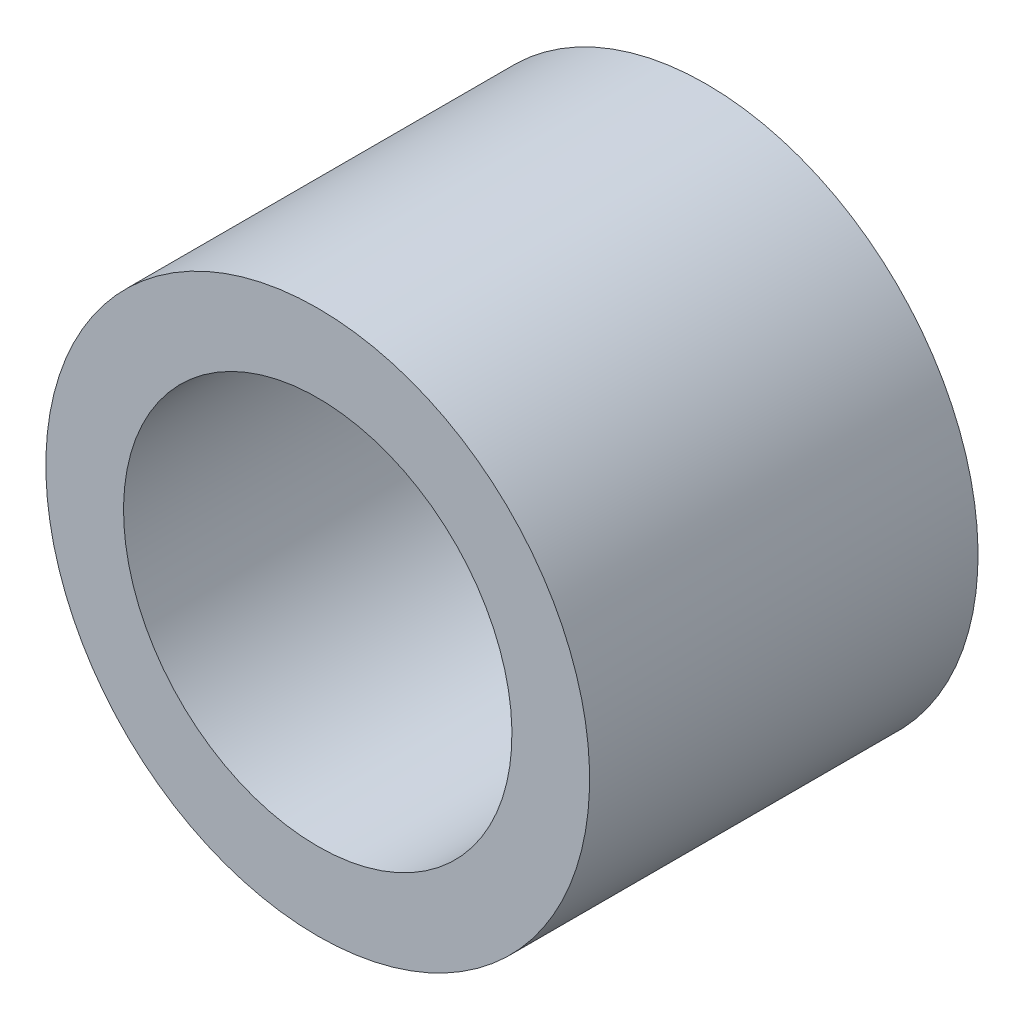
ISO-10303-21;
HEADER;
FILE_DESCRIPTION(('STEP AP214'),'2;1');
FILE_NAME('part.step','',(''),(''),'','','');
FILE_SCHEMA(('AUTOMOTIVE_DESIGN { 1 0 10303 214 1 1 1 1 }'));
ENDSEC;
DATA;
#1=APPLICATION_CONTEXT('core data for automotive mechanical design processes');
#2=APPLICATION_PROTOCOL_DEFINITION('international standard','automotive_design',2000,#1);
#3=PRODUCT_CONTEXT('',#1,'mechanical');
#4=PRODUCT('Part','Part','',(#3));
#5=PRODUCT_RELATED_PRODUCT_CATEGORY('part','',(#4));
#6=PRODUCT_DEFINITION_FORMATION('','',#4);
#7=PRODUCT_DEFINITION_CONTEXT('part definition',#1,'design');
#8=PRODUCT_DEFINITION('design','',#6,#7);
#9=PRODUCT_DEFINITION_SHAPE('','',#8);
#10=(LENGTH_UNIT() NAMED_UNIT(*) SI_UNIT(.MILLI.,.METRE.));
#11=(NAMED_UNIT(*) PLANE_ANGLE_UNIT() SI_UNIT($,.RADIAN.));
#12=(NAMED_UNIT(*) SI_UNIT($,.STERADIAN.) SOLID_ANGLE_UNIT());
#13=UNCERTAINTY_MEASURE_WITH_UNIT(LENGTH_MEASURE(1.E-05),#10,'distance_accuracy_value','');
#14=(GEOMETRIC_REPRESENTATION_CONTEXT(3) GLOBAL_UNCERTAINTY_ASSIGNED_CONTEXT((#13)) GLOBAL_UNIT_ASSIGNED_CONTEXT((#10,
#11,#12)) REPRESENTATION_CONTEXT('',''));
#15=CARTESIAN_POINT('',(0.,0.,0.));
#16=DIRECTION('',(0.,0.,1.));
#17=DIRECTION('',(1.,0.,0.));
#18=AXIS2_PLACEMENT_3D('',#15,#16,#17);
#19=CARTESIAN_POINT('',(17.5,0.,0.));
#20=DIRECTION('',(0.,0.,1.));
#21=DIRECTION('',(0.,-1.,0.));
#22=AXIS2_PLACEMENT_3D('',#19,#20,#21);
#23=PLANE('',#22);
#24=CARTESIAN_POINT('',(0.,0.,0.));
#25=DIRECTION('',(0.,0.,1.));
#26=DIRECTION('',(0.,-1.,0.));
#27=AXIS2_PLACEMENT_3D('',#24,#25,#26);
#28=CIRCLE('',#27,12.5);
#29=CARTESIAN_POINT('',(0.,-12.5,0.));
#30=VERTEX_POINT('',#29);
#31=EDGE_CURVE('E22',#30,#30,#28,.T.);
#32=ORIENTED_EDGE('',*,*,#31,.T.);
#33=EDGE_LOOP('',(#32));
#34=FACE_BOUND('',#33,.T.);
#35=CARTESIAN_POINT('',(0.,0.,0.));
#36=DIRECTION('',(0.,0.,-1.));
#37=DIRECTION('',(0.,1.,0.));
#38=AXIS2_PLACEMENT_3D('',#35,#36,#37);
#39=CIRCLE('',#38,17.5);
#40=CARTESIAN_POINT('',(0.,17.5,0.));
#41=VERTEX_POINT('',#40);
#42=EDGE_CURVE('E8',#41,#41,#39,.T.);
#43=ORIENTED_EDGE('',*,*,#42,.T.);
#44=EDGE_LOOP('',(#43));
#45=FACE_BOUND('',#44,.T.);
#46=ADVANCED_FACE('F12',(#34,#45),#23,.F.);
#47=CARTESIAN_POINT('',(0.,0.,-20.));
#48=DIRECTION('',(0.,0.,-1.));
#49=DIRECTION('',(0.,1.,0.));
#50=AXIS2_PLACEMENT_3D('',#47,#48,#49);
#51=CYLINDRICAL_SURFACE('',#50,17.5);
#52=ORIENTED_EDGE('',*,*,#42,.F.);
#53=EDGE_LOOP('',(#52));
#54=FACE_BOUND('',#53,.T.);
#55=CARTESIAN_POINT('',(0.,0.,25.));
#56=DIRECTION('',(0.,0.,1.));
#57=DIRECTION('',(0.,-1.,0.));
#58=AXIS2_PLACEMENT_3D('',#55,#56,#57);
#59=CIRCLE('',#58,17.5);
#60=CARTESIAN_POINT('',(0.,-17.5,25.));
#61=VERTEX_POINT('',#60);
#62=EDGE_CURVE('E18',#61,#61,#59,.T.);
#63=ORIENTED_EDGE('',*,*,#62,.F.);
#64=EDGE_LOOP('',(#63));
#65=FACE_BOUND('',#64,.T.);
#66=ADVANCED_FACE('F36',(#54,#65),#51,.T.);
#67=CARTESIAN_POINT('',(0.,0.,25.));
#68=DIRECTION('',(0.,0.,1.));
#69=DIRECTION('',(0.,-1.,0.));
#70=AXIS2_PLACEMENT_3D('',#67,#68,#69);
#71=PLANE('',#70);
#72=CARTESIAN_POINT('',(0.,0.,25.));
#73=DIRECTION('',(0.,0.,1.));
#74=DIRECTION('',(0.,-1.,0.));
#75=AXIS2_PLACEMENT_3D('',#72,#73,#74);
#76=CIRCLE('',#75,12.5);
#77=CARTESIAN_POINT('',(0.,-12.5,25.));
#78=VERTEX_POINT('',#77);
#79=EDGE_CURVE('E26',#78,#78,#76,.T.);
#80=ORIENTED_EDGE('',*,*,#79,.F.);
#81=EDGE_LOOP('',(#80));
#82=FACE_BOUND('',#81,.T.);
#83=ORIENTED_EDGE('',*,*,#62,.T.);
#84=EDGE_LOOP('',(#83));
#85=FACE_BOUND('',#84,.T.);
#86=ADVANCED_FACE('F34',(#82,#85),#71,.T.);
#87=CARTESIAN_POINT('',(0.,0.,0.));
#88=DIRECTION('',(0.,0.,1.));
#89=DIRECTION('',(0.,-1.,0.));
#90=AXIS2_PLACEMENT_3D('',#87,#88,#89);
#91=CYLINDRICAL_SURFACE('',#90,12.5);
#92=ORIENTED_EDGE('',*,*,#31,.F.);
#93=EDGE_LOOP('',(#92));
#94=FACE_BOUND('',#93,.T.);
#95=ORIENTED_EDGE('',*,*,#79,.T.);
#96=EDGE_LOOP('',(#95));
#97=FACE_BOUND('',#96,.T.);
#98=ADVANCED_FACE('F32',(#94,#97),#91,.F.);
#99=CLOSED_SHELL('',(#46,#66,#86,#98));
#100=MANIFOLD_SOLID_BREP('B1',#99);
#101=ADVANCED_BREP_SHAPE_REPRESENTATION('',(#18,#100),#14);
#102=SHAPE_DEFINITION_REPRESENTATION(#9,#101);
ENDSEC;
END-ISO-10303-21;
